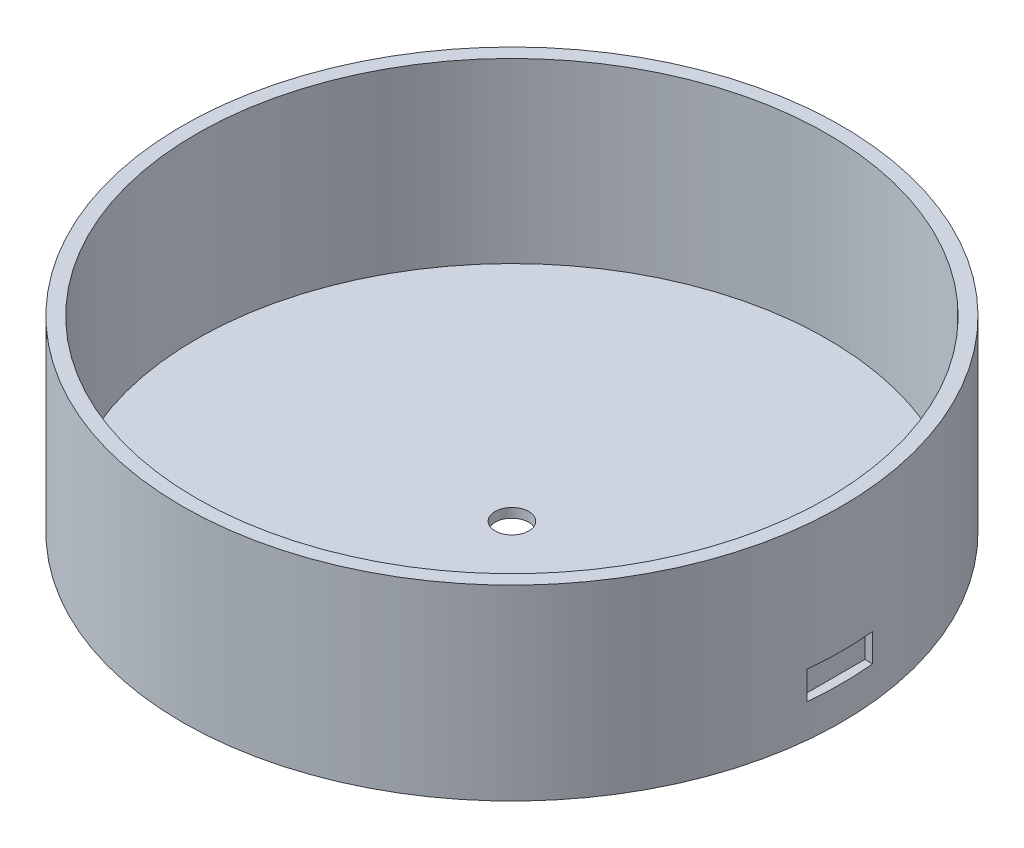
ISO-10303-21;
HEADER;
FILE_DESCRIPTION(('STEP AP214'),'2;1');
FILE_NAME('part.step','',(''),(''),'','','');
FILE_SCHEMA(('AUTOMOTIVE_DESIGN { 1 0 10303 214 1 1 1 1 }'));
ENDSEC;
DATA;
#1=APPLICATION_CONTEXT('core data for automotive mechanical design processes');
#2=APPLICATION_PROTOCOL_DEFINITION('international standard','automotive_design',2000,#1);
#3=PRODUCT_CONTEXT('',#1,'mechanical');
#4=PRODUCT('Part','Part','',(#3));
#5=PRODUCT_RELATED_PRODUCT_CATEGORY('part','',(#4));
#6=PRODUCT_DEFINITION_FORMATION('','',#4);
#7=PRODUCT_DEFINITION_CONTEXT('part definition',#1,'design');
#8=PRODUCT_DEFINITION('design','',#6,#7);
#9=PRODUCT_DEFINITION_SHAPE('','',#8);
#10=(LENGTH_UNIT() NAMED_UNIT(*) SI_UNIT(.MILLI.,.METRE.));
#11=(NAMED_UNIT(*) PLANE_ANGLE_UNIT() SI_UNIT($,.RADIAN.));
#12=(NAMED_UNIT(*) SI_UNIT($,.STERADIAN.) SOLID_ANGLE_UNIT());
#13=UNCERTAINTY_MEASURE_WITH_UNIT(LENGTH_MEASURE(1.E-05),#10,'distance_accuracy_value','');
#14=(GEOMETRIC_REPRESENTATION_CONTEXT(3) GLOBAL_UNCERTAINTY_ASSIGNED_CONTEXT((#13)) GLOBAL_UNIT_ASSIGNED_CONTEXT((#10,
#11,#12)) REPRESENTATION_CONTEXT('',''));
#15=CARTESIAN_POINT('',(0.,0.,0.));
#16=DIRECTION('',(0.,0.,1.));
#17=DIRECTION('',(1.,0.,0.));
#18=AXIS2_PLACEMENT_3D('',#15,#16,#17);
#19=CARTESIAN_POINT('',(0.,40.,0.));
#20=DIRECTION('',(0.,-1.,0.));
#21=DIRECTION('',(0.,0.,-1.));
#22=AXIS2_PLACEMENT_3D('',#19,#20,#21);
#23=CYLINDRICAL_SURFACE('',#22,70.5);
#24=DIRECTION('',(0.,-1.,0.));
#25=VECTOR('',#24,1.);
#26=CARTESIAN_POINT('',(70.1516215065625,40.,7.));
#27=LINE('',#26,#25);
#28=CARTESIAN_POINT('',(70.1516215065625,7.14000000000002,7.));
#29=VERTEX_POINT('',#28);
#30=CARTESIAN_POINT('',(70.1516215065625,13.14,7.));
#31=VERTEX_POINT('',#30);
#32=EDGE_CURVE('E178',#29,#31,#27,.F.);
#33=ORIENTED_EDGE('',*,*,#32,.T.);
#34=CARTESIAN_POINT('',(0.,13.14,0.));
#35=DIRECTION('',(0.,1.,0.));
#36=DIRECTION('',(0.,0.,1.));
#37=AXIS2_PLACEMENT_3D('',#34,#35,#36);
#38=CIRCLE('',#37,70.5);
#39=CARTESIAN_POINT('',(70.1516215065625,13.14,-7.));
#40=VERTEX_POINT('',#39);
#41=EDGE_CURVE('E169',#31,#40,#38,.T.);
#42=ORIENTED_EDGE('',*,*,#41,.T.);
#43=DIRECTION('',(0.,-1.,0.));
#44=VECTOR('',#43,1.);
#45=CARTESIAN_POINT('',(70.1516215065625,40.,-7.));
#46=LINE('',#45,#44);
#47=CARTESIAN_POINT('',(70.1516215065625,7.14000000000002,-7.));
#48=VERTEX_POINT('',#47);
#49=EDGE_CURVE('E175',#40,#48,#46,.T.);
#50=ORIENTED_EDGE('',*,*,#49,.T.);
#51=CARTESIAN_POINT('',(0.,7.14000000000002,0.));
#52=DIRECTION('',(0.,-1.,0.));
#53=DIRECTION('',(0.,0.,-1.));
#54=AXIS2_PLACEMENT_3D('',#51,#52,#53);
#55=CIRCLE('',#54,70.5);
#56=EDGE_CURVE('E59',#48,#29,#55,.T.);
#57=ORIENTED_EDGE('',*,*,#56,.T.);
#58=EDGE_LOOP('',(#33,#42,#50,#57));
#59=FACE_BOUND('',#58,.T.);
#60=CARTESIAN_POINT('',(0.,40.,0.));
#61=DIRECTION('',(0.,1.,0.));
#62=DIRECTION('',(0.,0.,1.));
#63=AXIS2_PLACEMENT_3D('',#60,#61,#62);
#64=CIRCLE('',#63,70.5);
#65=CARTESIAN_POINT('',(0.,40.,70.5));
#66=VERTEX_POINT('',#65);
#67=EDGE_CURVE('E157',#66,#66,#64,.T.);
#68=ORIENTED_EDGE('',*,*,#67,.F.);
#69=EDGE_LOOP('',(#68));
#70=FACE_BOUND('',#69,.T.);
#71=CARTESIAN_POINT('',(0.,0.,0.));
#72=DIRECTION('',(0.,1.,0.));
#73=DIRECTION('',(0.,0.,1.));
#74=AXIS2_PLACEMENT_3D('',#71,#72,#73);
#75=CIRCLE('',#74,70.5);
#76=CARTESIAN_POINT('',(0.,0.,70.5));
#77=VERTEX_POINT('',#76);
#78=EDGE_CURVE('E146',#77,#77,#75,.T.);
#79=ORIENTED_EDGE('',*,*,#78,.T.);
#80=EDGE_LOOP('',(#79));
#81=FACE_BOUND('',#80,.T.);
#82=CARTESIAN_POINT('',(0.,13.14,0.));
#83=DIRECTION('',(0.,-1.,0.));
#84=DIRECTION('',(0.,0.,-1.));
#85=AXIS2_PLACEMENT_3D('',#82,#83,#84);
#86=CIRCLE('',#85,70.5);
#87=CARTESIAN_POINT('',(-70.1516215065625,13.14,7.));
#88=VERTEX_POINT('',#87);
#89=CARTESIAN_POINT('',(-70.1516215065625,13.14,-7.));
#90=VERTEX_POINT('',#89);
#91=EDGE_CURVE('E181',#88,#90,#86,.T.);
#92=ORIENTED_EDGE('',*,*,#91,.F.);
#93=DIRECTION('',(0.,-1.,0.));
#94=VECTOR('',#93,1.);
#95=CARTESIAN_POINT('',(-70.1516215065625,40.,7.));
#96=LINE('',#95,#94);
#97=CARTESIAN_POINT('',(-70.1516215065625,7.14000000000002,7.));
#98=VERTEX_POINT('',#97);
#99=EDGE_CURVE('E11',#98,#88,#96,.F.);
#100=ORIENTED_EDGE('',*,*,#99,.F.);
#101=CARTESIAN_POINT('',(0.,7.14000000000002,0.));
#102=DIRECTION('',(0.,1.,0.));
#103=DIRECTION('',(0.,0.,1.));
#104=AXIS2_PLACEMENT_3D('',#101,#102,#103);
#105=CIRCLE('',#104,70.5);
#106=CARTESIAN_POINT('',(-70.1516215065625,7.14000000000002,-7.));
#107=VERTEX_POINT('',#106);
#108=EDGE_CURVE('E45',#107,#98,#105,.T.);
#109=ORIENTED_EDGE('',*,*,#108,.F.);
#110=DIRECTION('',(0.,-1.,0.));
#111=VECTOR('',#110,1.);
#112=CARTESIAN_POINT('',(-70.1516215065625,40.,-7.));
#113=LINE('',#112,#111);
#114=EDGE_CURVE('E183',#90,#107,#113,.T.);
#115=ORIENTED_EDGE('',*,*,#114,.F.);
#116=EDGE_LOOP('',(#92,#100,#109,#115));
#117=FACE_BOUND('',#116,.T.);
#118=ADVANCED_FACE('F37',(#59,#70,#81,#117),#23,.T.);
#119=CARTESIAN_POINT('',(0.,2.,0.));
#120=DIRECTION('',(0.,-1.,0.));
#121=DIRECTION('',(0.,0.,-1.));
#122=AXIS2_PLACEMENT_3D('',#119,#120,#121);
#123=CYLINDRICAL_SURFACE('',#122,3.6);
#124=CARTESIAN_POINT('',(0.,2.,0.));
#125=DIRECTION('',(0.,1.,0.));
#126=DIRECTION('',(0.,0.,1.));
#127=AXIS2_PLACEMENT_3D('',#124,#125,#126);
#128=CIRCLE('',#127,3.6);
#129=CARTESIAN_POINT('',(0.,2.,3.6));
#130=VERTEX_POINT('',#129);
#131=EDGE_CURVE('E166',#130,#130,#128,.T.);
#132=ORIENTED_EDGE('',*,*,#131,.T.);
#133=EDGE_LOOP('',(#132));
#134=FACE_BOUND('',#133,.T.);
#135=CARTESIAN_POINT('',(0.,0.,0.));
#136=DIRECTION('',(0.,1.,0.));
#137=DIRECTION('',(0.,0.,1.));
#138=AXIS2_PLACEMENT_3D('',#135,#136,#137);
#139=CIRCLE('',#138,3.6);
#140=CARTESIAN_POINT('',(0.,0.,3.6));
#141=VERTEX_POINT('',#140);
#142=EDGE_CURVE('E165',#141,#141,#139,.T.);
#143=ORIENTED_EDGE('',*,*,#142,.F.);
#144=EDGE_LOOP('',(#143));
#145=FACE_BOUND('',#144,.T.);
#146=ADVANCED_FACE('F39',(#134,#145),#123,.F.);
#147=CARTESIAN_POINT('',(0.,2.,0.));
#148=DIRECTION('',(0.,1.,0.));
#149=DIRECTION('',(0.,0.,1.));
#150=AXIS2_PLACEMENT_3D('',#147,#148,#149);
#151=PLANE('',#150);
#152=ORIENTED_EDGE('',*,*,#131,.F.);
#153=EDGE_LOOP('',(#152));
#154=FACE_BOUND('',#153,.T.);
#155=CARTESIAN_POINT('',(0.,2.,0.));
#156=DIRECTION('',(0.,1.,0.));
#157=DIRECTION('',(0.,0.,1.));
#158=AXIS2_PLACEMENT_3D('',#155,#156,#157);
#159=CIRCLE('',#158,67.5);
#160=CARTESIAN_POINT('',(0.,2.,67.5));
#161=VERTEX_POINT('',#160);
#162=EDGE_CURVE('E160',#161,#161,#159,.F.);
#163=ORIENTED_EDGE('',*,*,#162,.F.);
#164=EDGE_LOOP('',(#163));
#165=FACE_BOUND('',#164,.T.);
#166=ADVANCED_FACE('F206',(#154,#165),#151,.T.);
#167=CARTESIAN_POINT('',(0.,0.,0.));
#168=DIRECTION('',(0.,1.,0.));
#169=DIRECTION('',(0.,0.,1.));
#170=AXIS2_PLACEMENT_3D('',#167,#168,#169);
#171=PLANE('',#170);
#172=ORIENTED_EDGE('',*,*,#142,.T.);
#173=EDGE_LOOP('',(#172));
#174=FACE_BOUND('',#173,.T.);
#175=ORIENTED_EDGE('',*,*,#78,.F.);
#176=EDGE_LOOP('',(#175));
#177=FACE_BOUND('',#176,.T.);
#178=ADVANCED_FACE('F216',(#174,#177),#171,.F.);
#179=CARTESIAN_POINT('',(0.,40.,0.));
#180=DIRECTION('',(0.,-1.,0.));
#181=DIRECTION('',(0.,0.,-1.));
#182=AXIS2_PLACEMENT_3D('',#179,#180,#181);
#183=CYLINDRICAL_SURFACE('',#182,67.5);
#184=ORIENTED_EDGE('',*,*,#162,.T.);
#185=EDGE_LOOP('',(#184));
#186=FACE_BOUND('',#185,.T.);
#187=CARTESIAN_POINT('',(0.,40.,0.));
#188=DIRECTION('',(0.,1.,0.));
#189=DIRECTION('',(0.,0.,1.));
#190=AXIS2_PLACEMENT_3D('',#187,#188,#189);
#191=CIRCLE('',#190,67.5);
#192=CARTESIAN_POINT('',(0.,40.,67.5));
#193=VERTEX_POINT('',#192);
#194=EDGE_CURVE('E154',#193,#193,#191,.T.);
#195=ORIENTED_EDGE('',*,*,#194,.T.);
#196=EDGE_LOOP('',(#195));
#197=FACE_BOUND('',#196,.T.);
#198=ADVANCED_FACE('F213',(#186,#197),#183,.F.);
#199=CARTESIAN_POINT('',(0.,40.,0.));
#200=DIRECTION('',(0.,1.,0.));
#201=DIRECTION('',(0.,0.,1.));
#202=AXIS2_PLACEMENT_3D('',#199,#200,#201);
#203=PLANE('',#202);
#204=ORIENTED_EDGE('',*,*,#194,.F.);
#205=EDGE_LOOP('',(#204));
#206=FACE_BOUND('',#205,.T.);
#207=ORIENTED_EDGE('',*,*,#67,.T.);
#208=EDGE_LOOP('',(#207));
#209=FACE_BOUND('',#208,.T.);
#210=ADVANCED_FACE('F211',(#206,#209),#203,.T.);
#211=CARTESIAN_POINT('',(68.5,7.14000000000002,0.));
#212=DIRECTION('',(0.,-1.,0.));
#213=DIRECTION('',(0.,0.,-1.));
#214=AXIS2_PLACEMENT_3D('',#211,#212,#213);
#215=PLANE('',#214);
#216=DIRECTION('',(1.,0.,0.));
#217=VECTOR('',#216,1.);
#218=CARTESIAN_POINT('',(68.5,7.14000000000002,-7.));
#219=LINE('',#218,#217);
#220=CARTESIAN_POINT('',(68.5,7.14000000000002,-7.));
#221=VERTEX_POINT('',#220);
#222=EDGE_CURVE('E143',#221,#48,#219,.T.);
#223=ORIENTED_EDGE('',*,*,#222,.F.);
#224=DIRECTION('',(0.,0.,-1.));
#225=VECTOR('',#224,1.);
#226=CARTESIAN_POINT('',(68.5,7.14000000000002,0.));
#227=LINE('',#226,#225);
#228=CARTESIAN_POINT('',(68.5,7.14000000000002,7.));
#229=VERTEX_POINT('',#228);
#230=EDGE_CURVE('E127',#229,#221,#227,.T.);
#231=ORIENTED_EDGE('',*,*,#230,.F.);
#232=DIRECTION('',(1.,0.,0.));
#233=VECTOR('',#232,1.);
#234=CARTESIAN_POINT('',(68.5,7.14000000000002,7.));
#235=LINE('',#234,#233);
#236=EDGE_CURVE('E144',#229,#29,#235,.T.);
#237=ORIENTED_EDGE('',*,*,#236,.T.);
#238=ORIENTED_EDGE('',*,*,#56,.F.);
#239=EDGE_LOOP('',(#223,#231,#237,#238));
#240=FACE_BOUND('',#239,.T.);
#241=ADVANCED_FACE('F241',(#240),#215,.F.);
#242=CARTESIAN_POINT('',(68.5,0.,7.));
#243=DIRECTION('',(0.,0.,1.));
#244=DIRECTION('',(0.,-1.,0.));
#245=AXIS2_PLACEMENT_3D('',#242,#243,#244);
#246=PLANE('',#245);
#247=ORIENTED_EDGE('',*,*,#236,.F.);
#248=DIRECTION('',(0.,-1.,0.));
#249=VECTOR('',#248,1.);
#250=CARTESIAN_POINT('',(68.5,0.,7.));
#251=LINE('',#250,#249);
#252=CARTESIAN_POINT('',(68.5,13.14,7.));
#253=VERTEX_POINT('',#252);
#254=EDGE_CURVE('E140',#253,#229,#251,.T.);
#255=ORIENTED_EDGE('',*,*,#254,.F.);
#256=DIRECTION('',(1.,0.,0.));
#257=VECTOR('',#256,1.);
#258=CARTESIAN_POINT('',(68.5,13.14,7.));
#259=LINE('',#258,#257);
#260=EDGE_CURVE('E147',#253,#31,#259,.T.);
#261=ORIENTED_EDGE('',*,*,#260,.T.);
#262=ORIENTED_EDGE('',*,*,#32,.F.);
#263=EDGE_LOOP('',(#247,#255,#261,#262));
#264=FACE_BOUND('',#263,.T.);
#265=ADVANCED_FACE('F248',(#264),#246,.F.);
#266=CARTESIAN_POINT('',(68.5,13.14,0.));
#267=DIRECTION('',(0.,1.,0.));
#268=DIRECTION('',(0.,0.,1.));
#269=AXIS2_PLACEMENT_3D('',#266,#267,#268);
#270=PLANE('',#269);
#271=ORIENTED_EDGE('',*,*,#260,.F.);
#272=DIRECTION('',(0.,0.,1.));
#273=VECTOR('',#272,1.);
#274=CARTESIAN_POINT('',(68.5,13.14,0.));
#275=LINE('',#274,#273);
#276=CARTESIAN_POINT('',(68.5,13.14,-7.));
#277=VERTEX_POINT('',#276);
#278=EDGE_CURVE('E137',#277,#253,#275,.T.);
#279=ORIENTED_EDGE('',*,*,#278,.F.);
#280=DIRECTION('',(1.,0.,0.));
#281=VECTOR('',#280,1.);
#282=CARTESIAN_POINT('',(68.5,13.14,-7.));
#283=LINE('',#282,#281);
#284=EDGE_CURVE('E150',#277,#40,#283,.T.);
#285=ORIENTED_EDGE('',*,*,#284,.T.);
#286=ORIENTED_EDGE('',*,*,#41,.F.);
#287=EDGE_LOOP('',(#271,#279,#285,#286));
#288=FACE_BOUND('',#287,.T.);
#289=ADVANCED_FACE('F254',(#288),#270,.F.);
#290=CARTESIAN_POINT('',(68.5,0.,-7.));
#291=DIRECTION('',(0.,0.,-1.));
#292=DIRECTION('',(0.,1.,0.));
#293=AXIS2_PLACEMENT_3D('',#290,#291,#292);
#294=PLANE('',#293);
#295=ORIENTED_EDGE('',*,*,#284,.F.);
#296=DIRECTION('',(0.,1.,0.));
#297=VECTOR('',#296,1.);
#298=CARTESIAN_POINT('',(68.5,0.,-7.));
#299=LINE('',#298,#297);
#300=EDGE_CURVE('E134',#221,#277,#299,.T.);
#301=ORIENTED_EDGE('',*,*,#300,.F.);
#302=ORIENTED_EDGE('',*,*,#222,.T.);
#303=ORIENTED_EDGE('',*,*,#49,.F.);
#304=EDGE_LOOP('',(#295,#301,#302,#303));
#305=FACE_BOUND('',#304,.T.);
#306=ADVANCED_FACE('F262',(#305),#294,.F.);
#307=CARTESIAN_POINT('',(68.5,0.,0.));
#308=DIRECTION('',(1.,0.,0.));
#309=DIRECTION('',(0.,0.,-1.));
#310=AXIS2_PLACEMENT_3D('',#307,#308,#309);
#311=PLANE('',#310);
#312=ORIENTED_EDGE('',*,*,#230,.T.);
#313=ORIENTED_EDGE('',*,*,#300,.T.);
#314=ORIENTED_EDGE('',*,*,#278,.T.);
#315=ORIENTED_EDGE('',*,*,#254,.T.);
#316=EDGE_LOOP('',(#312,#313,#314,#315));
#317=FACE_BOUND('',#316,.T.);
#318=ADVANCED_FACE('F270',(#317),#311,.T.);
#319=CARTESIAN_POINT('',(-68.5,7.14000000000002,0.));
#320=DIRECTION('',(0.,1.,0.));
#321=DIRECTION('',(0.,0.,1.));
#322=AXIS2_PLACEMENT_3D('',#319,#320,#321);
#323=PLANE('',#322);
#324=DIRECTION('',(-1.,0.,0.));
#325=VECTOR('',#324,1.);
#326=CARTESIAN_POINT('',(-68.5,7.14000000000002,-7.));
#327=LINE('',#326,#325);
#328=CARTESIAN_POINT('',(-68.5,7.14000000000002,-7.));
#329=VERTEX_POINT('',#328);
#330=EDGE_CURVE('E125',#329,#107,#327,.T.);
#331=ORIENTED_EDGE('',*,*,#330,.T.);
#332=ORIENTED_EDGE('',*,*,#108,.T.);
#333=DIRECTION('',(-1.,0.,0.));
#334=VECTOR('',#333,1.);
#335=CARTESIAN_POINT('',(-68.5,7.14000000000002,7.));
#336=LINE('',#335,#334);
#337=CARTESIAN_POINT('',(-68.5,7.14000000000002,7.));
#338=VERTEX_POINT('',#337);
#339=EDGE_CURVE('E51',#338,#98,#336,.T.);
#340=ORIENTED_EDGE('',*,*,#339,.F.);
#341=DIRECTION('',(0.,0.,-1.));
#342=VECTOR('',#341,1.);
#343=CARTESIAN_POINT('',(-68.5,7.14000000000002,0.));
#344=LINE('',#343,#342);
#345=EDGE_CURVE('E110',#338,#329,#344,.T.);
#346=ORIENTED_EDGE('',*,*,#345,.T.);
#347=EDGE_LOOP('',(#331,#332,#340,#346));
#348=FACE_BOUND('',#347,.T.);
#349=ADVANCED_FACE('F115',(#348),#323,.T.);
#350=CARTESIAN_POINT('',(-68.5,0.,-7.));
#351=DIRECTION('',(0.,0.,1.));
#352=DIRECTION('',(0.,-1.,0.));
#353=AXIS2_PLACEMENT_3D('',#350,#351,#352);
#354=PLANE('',#353);
#355=ORIENTED_EDGE('',*,*,#114,.T.);
#356=ORIENTED_EDGE('',*,*,#330,.F.);
#357=DIRECTION('',(0.,1.,0.));
#358=VECTOR('',#357,1.);
#359=CARTESIAN_POINT('',(-68.5,0.,-7.));
#360=LINE('',#359,#358);
#361=CARTESIAN_POINT('',(-68.5,13.14,-7.));
#362=VERTEX_POINT('',#361);
#363=EDGE_CURVE('E118',#329,#362,#360,.T.);
#364=ORIENTED_EDGE('',*,*,#363,.T.);
#365=DIRECTION('',(-1.,0.,0.));
#366=VECTOR('',#365,1.);
#367=CARTESIAN_POINT('',(-68.5,13.14,-7.));
#368=LINE('',#367,#366);
#369=EDGE_CURVE('E128',#362,#90,#368,.T.);
#370=ORIENTED_EDGE('',*,*,#369,.T.);
#371=EDGE_LOOP('',(#355,#356,#364,#370));
#372=FACE_BOUND('',#371,.T.);
#373=ADVANCED_FACE('F187',(#372),#354,.T.);
#374=CARTESIAN_POINT('',(-68.5,13.14,0.));
#375=DIRECTION('',(0.,-1.,0.));
#376=DIRECTION('',(0.,0.,-1.));
#377=AXIS2_PLACEMENT_3D('',#374,#375,#376);
#378=PLANE('',#377);
#379=DIRECTION('',(-1.,0.,0.));
#380=VECTOR('',#379,1.);
#381=CARTESIAN_POINT('',(-68.5,13.14,7.));
#382=LINE('',#381,#380);
#383=CARTESIAN_POINT('',(-68.5,13.14,7.));
#384=VERTEX_POINT('',#383);
#385=EDGE_CURVE('E105',#384,#88,#382,.T.);
#386=ORIENTED_EDGE('',*,*,#385,.T.);
#387=ORIENTED_EDGE('',*,*,#91,.T.);
#388=ORIENTED_EDGE('',*,*,#369,.F.);
#389=DIRECTION('',(0.,0.,1.));
#390=VECTOR('',#389,1.);
#391=CARTESIAN_POINT('',(-68.5,13.14,0.));
#392=LINE('',#391,#390);
#393=EDGE_CURVE('E109',#362,#384,#392,.T.);
#394=ORIENTED_EDGE('',*,*,#393,.T.);
#395=EDGE_LOOP('',(#386,#387,#388,#394));
#396=FACE_BOUND('',#395,.T.);
#397=ADVANCED_FACE('F191',(#396),#378,.T.);
#398=CARTESIAN_POINT('',(-68.5,0.,7.));
#399=DIRECTION('',(0.,0.,-1.));
#400=DIRECTION('',(0.,1.,0.));
#401=AXIS2_PLACEMENT_3D('',#398,#399,#400);
#402=PLANE('',#401);
#403=ORIENTED_EDGE('',*,*,#99,.T.);
#404=ORIENTED_EDGE('',*,*,#385,.F.);
#405=DIRECTION('',(0.,-1.,0.));
#406=VECTOR('',#405,1.);
#407=CARTESIAN_POINT('',(-68.5,0.,7.));
#408=LINE('',#407,#406);
#409=EDGE_CURVE('E102',#384,#338,#408,.T.);
#410=ORIENTED_EDGE('',*,*,#409,.T.);
#411=ORIENTED_EDGE('',*,*,#339,.T.);
#412=EDGE_LOOP('',(#403,#404,#410,#411));
#413=FACE_BOUND('',#412,.T.);
#414=ADVANCED_FACE('F103',(#413),#402,.T.);
#415=CARTESIAN_POINT('',(-68.5,0.,0.));
#416=DIRECTION('',(-1.,0.,0.));
#417=DIRECTION('',(0.,0.,-1.));
#418=AXIS2_PLACEMENT_3D('',#415,#416,#417);
#419=PLANE('',#418);
#420=ORIENTED_EDGE('',*,*,#345,.F.);
#421=ORIENTED_EDGE('',*,*,#409,.F.);
#422=ORIENTED_EDGE('',*,*,#393,.F.);
#423=ORIENTED_EDGE('',*,*,#363,.F.);
#424=EDGE_LOOP('',(#420,#421,#422,#423));
#425=FACE_BOUND('',#424,.T.);
#426=ADVANCED_FACE('F120',(#425),#419,.T.);
#427=CLOSED_SHELL('',(#118,#146,#166,#178,#198,#210,#241,#265,#289,#306,#318,#349,#373,#397,
#414,#426));
#428=MANIFOLD_SOLID_BREP('B2',#427);
#429=ADVANCED_BREP_SHAPE_REPRESENTATION('',(#18,#428),#14);
#430=SHAPE_DEFINITION_REPRESENTATION(#9,#429);
ENDSEC;
END-ISO-10303-21;
